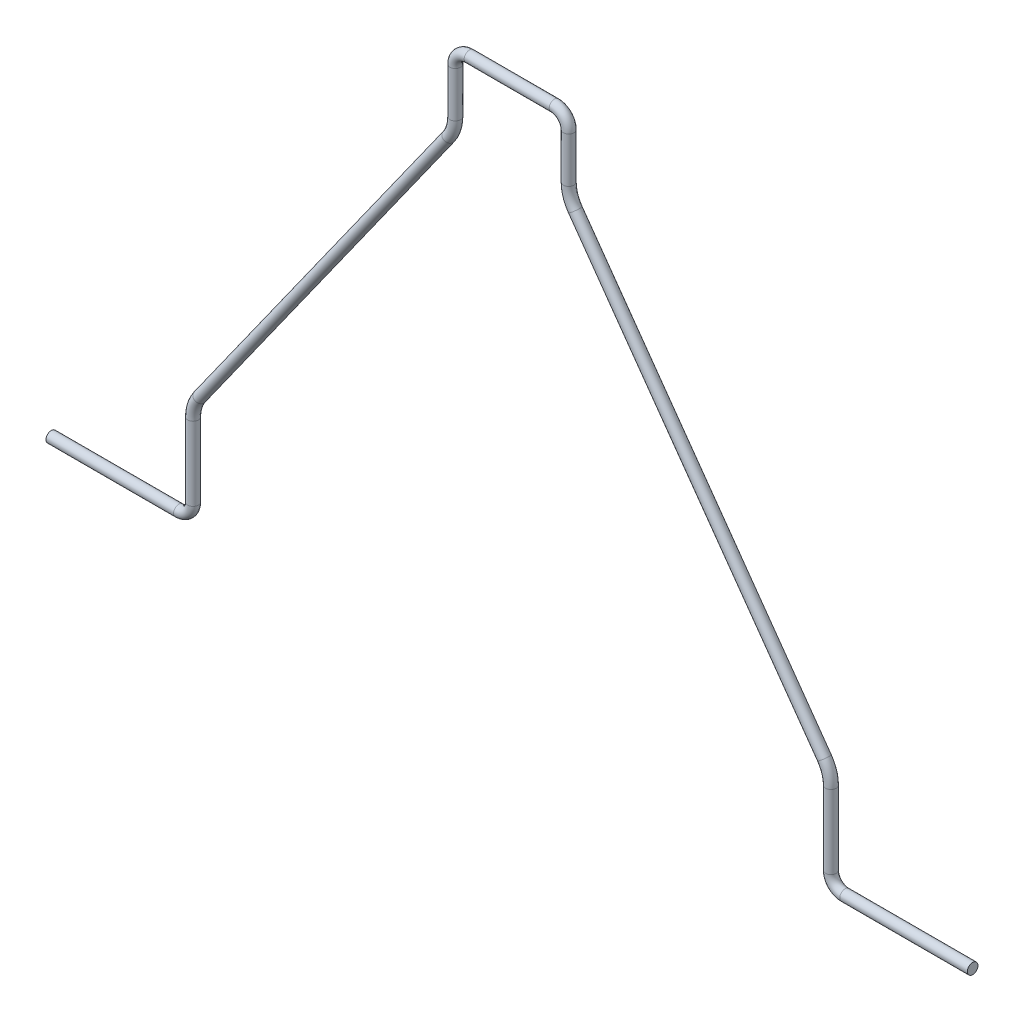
ISO-10303-21;
HEADER;
FILE_DESCRIPTION(('STEP AP214'),'2;1');
FILE_NAME('part.step','',(''),(''),'','','');
FILE_SCHEMA(('AUTOMOTIVE_DESIGN { 1 0 10303 214 1 1 1 1 }'));
ENDSEC;
DATA;
#1=APPLICATION_CONTEXT('core data for automotive mechanical design processes');
#2=APPLICATION_PROTOCOL_DEFINITION('international standard','automotive_design',2000,#1);
#3=PRODUCT_CONTEXT('',#1,'mechanical');
#4=PRODUCT('Part','Part','',(#3));
#5=PRODUCT_RELATED_PRODUCT_CATEGORY('part','',(#4));
#6=PRODUCT_DEFINITION_FORMATION('','',#4);
#7=PRODUCT_DEFINITION_CONTEXT('part definition',#1,'design');
#8=PRODUCT_DEFINITION('design','',#6,#7);
#9=PRODUCT_DEFINITION_SHAPE('','',#8);
#10=(LENGTH_UNIT() NAMED_UNIT(*) SI_UNIT(.MILLI.,.METRE.));
#11=(NAMED_UNIT(*) PLANE_ANGLE_UNIT() SI_UNIT($,.RADIAN.));
#12=(NAMED_UNIT(*) SI_UNIT($,.STERADIAN.) SOLID_ANGLE_UNIT());
#13=UNCERTAINTY_MEASURE_WITH_UNIT(LENGTH_MEASURE(1.E-05),#10,'distance_accuracy_value','');
#14=(GEOMETRIC_REPRESENTATION_CONTEXT(3) GLOBAL_UNCERTAINTY_ASSIGNED_CONTEXT((#13)) GLOBAL_UNIT_ASSIGNED_CONTEXT((#10,
#11,#12)) REPRESENTATION_CONTEXT('',''));
#15=CARTESIAN_POINT('',(0.,0.,0.));
#16=DIRECTION('',(0.,0.,1.));
#17=DIRECTION('',(1.,0.,0.));
#18=AXIS2_PLACEMENT_3D('',#15,#16,#17);
#19=CARTESIAN_POINT('',(112.,0.,0.));
#20=DIRECTION('',(1.,0.,0.));
#21=DIRECTION('',(0.,1.,0.));
#22=AXIS2_PLACEMENT_3D('',#19,#20,#21);
#23=CYLINDRICAL_SURFACE('',#22,0.75);
#24=CARTESIAN_POINT('',(112.,0.,0.));
#25=DIRECTION('',(1.,0.,0.));
#26=DIRECTION('',(0.,0.,-1.));
#27=AXIS2_PLACEMENT_3D('',#24,#25,#26);
#28=CIRCLE('',#27,0.75);
#29=CARTESIAN_POINT('',(112.,-0.74999999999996,0.));
#30=VERTEX_POINT('',#29);
#31=EDGE_CURVE('E36',#30,#30,#28,.T.);
#32=ORIENTED_EDGE('',*,*,#31,.T.);
#33=EDGE_LOOP('',(#32));
#34=FACE_BOUND('',#33,.T.);
#35=CARTESIAN_POINT('',(130.,0.,0.));
#36=DIRECTION('',(1.,0.,0.));
#37=DIRECTION('',(0.,0.,-1.));
#38=AXIS2_PLACEMENT_3D('',#35,#36,#37);
#39=CIRCLE('',#38,0.75);
#40=CARTESIAN_POINT('',(130.,0.,-0.75));
#41=VERTEX_POINT('',#40);
#42=EDGE_CURVE('E10',#41,#41,#39,.T.);
#43=ORIENTED_EDGE('',*,*,#42,.F.);
#44=EDGE_LOOP('',(#43));
#45=FACE_BOUND('',#44,.T.);
#46=ADVANCED_FACE('F30',(#34,#45),#23,.T.);
#47=CARTESIAN_POINT('',(112.,2.00000000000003,0.));
#48=DIRECTION('',(0.,0.,1.));
#49=DIRECTION('',(1.,0.,0.));
#50=AXIS2_PLACEMENT_3D('',#47,#48,#49);
#51=TOROIDAL_SURFACE('',#50,1.99999999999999,0.75);
#52=CARTESIAN_POINT('',(110.,2.00000000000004,0.));
#53=DIRECTION('',(0.,-1.,0.));
#54=DIRECTION('',(0.,0.,-1.));
#55=AXIS2_PLACEMENT_3D('',#52,#53,#54);
#56=CIRCLE('',#55,0.75);
#57=CARTESIAN_POINT('',(109.25,2.00000000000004,0.));
#58=VERTEX_POINT('',#57);
#59=EDGE_CURVE('E40',#58,#58,#56,.T.);
#60=CARTESIAN_POINT('',(112.,2.00000000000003,0.));
#61=DIRECTION('',(0.,0.,1.));
#62=DIRECTION('',(1.,0.,0.));
#63=AXIS2_PLACEMENT_3D('',#60,#61,#62);
#64=CIRCLE('',#63,2.74999999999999);
#65=EDGE_CURVE('',#58,#30,#64,.T.);
#66=ORIENTED_EDGE('',*,*,#59,.T.);
#67=ORIENTED_EDGE('',*,*,#31,.F.);
#68=ORIENTED_EDGE('',*,*,#65,.T.);
#69=ORIENTED_EDGE('',*,*,#65,.F.);
#70=EDGE_LOOP('',(#66,#68,#67,#69));
#71=FACE_BOUND('',#70,.T.);
#72=ADVANCED_FACE('F110',(#71),#51,.T.);
#73=CARTESIAN_POINT('',(110.,12.4026946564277,0.));
#74=DIRECTION('',(0.,-1.,0.));
#75=DIRECTION('',(0.,0.,-1.));
#76=AXIS2_PLACEMENT_3D('',#73,#74,#75);
#77=CYLINDRICAL_SURFACE('',#76,0.75);
#78=CARTESIAN_POINT('',(110.,12.4026946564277,0.));
#79=DIRECTION('',(0.,-1.,0.));
#80=DIRECTION('',(0.,0.,-1.));
#81=AXIS2_PLACEMENT_3D('',#78,#79,#80);
#82=CIRCLE('',#81,0.75);
#83=CARTESIAN_POINT('',(110.75,12.4026946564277,0.));
#84=VERTEX_POINT('',#83);
#85=EDGE_CURVE('E44',#84,#84,#82,.T.);
#86=ORIENTED_EDGE('',*,*,#85,.T.);
#87=EDGE_LOOP('',(#86));
#88=FACE_BOUND('',#87,.T.);
#89=ORIENTED_EDGE('',*,*,#59,.F.);
#90=EDGE_LOOP('',(#89));
#91=FACE_BOUND('',#90,.T.);
#92=ADVANCED_FACE('F114',(#88,#91),#77,.T.);
#93=CARTESIAN_POINT('',(105.,12.4026946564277,0.));
#94=DIRECTION('',(0.,0.,-1.));
#95=DIRECTION('',(-1.,0.,0.));
#96=AXIS2_PLACEMENT_3D('',#93,#94,#95);
#97=TOROIDAL_SURFACE('',#96,5.00000000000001,0.75);
#98=CARTESIAN_POINT('',(109.073954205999,15.3014697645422,0.));
#99=DIRECTION('',(0.579755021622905,-0.814790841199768,0.));
#100=DIRECTION('',(0.,0.,-1.));
#101=AXIS2_PLACEMENT_3D('',#98,#99,#100);
#102=CIRCLE('',#101,0.75);
#103=CARTESIAN_POINT('',(109.685047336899,15.7362860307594,0.));
#104=VERTEX_POINT('',#103);
#105=EDGE_CURVE('E49',#104,#104,#102,.T.);
#106=CARTESIAN_POINT('',(105.,12.4026946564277,0.));
#107=DIRECTION('',(0.,0.,-1.));
#108=DIRECTION('',(-1.,0.,0.));
#109=AXIS2_PLACEMENT_3D('',#106,#107,#108);
#110=CIRCLE('',#109,5.75000000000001);
#111=EDGE_CURVE('',#104,#84,#110,.T.);
#112=ORIENTED_EDGE('',*,*,#105,.T.);
#113=ORIENTED_EDGE('',*,*,#85,.F.);
#114=ORIENTED_EDGE('',*,*,#111,.T.);
#115=ORIENTED_EDGE('',*,*,#111,.F.);
#116=EDGE_LOOP('',(#112,#114,#113,#115));
#117=FACE_BOUND('',#116,.T.);
#118=ADVANCED_FACE('F120',(#117),#97,.T.);
#119=CARTESIAN_POINT('',(73.9260457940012,64.6985302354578,0.));
#120=DIRECTION('',(0.57975502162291,-0.814790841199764,0.));
#121=DIRECTION('',(0.814790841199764,0.57975502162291,0.));
#122=AXIS2_PLACEMENT_3D('',#119,#120,#121);
#123=CYLINDRICAL_SURFACE('',#122,0.75);
#124=CARTESIAN_POINT('',(73.9260457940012,64.6985302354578,0.));
#125=DIRECTION('',(0.579755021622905,-0.814790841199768,0.));
#126=DIRECTION('',(0.,0.,-1.));
#127=AXIS2_PLACEMENT_3D('',#124,#125,#126);
#128=CIRCLE('',#127,0.75);
#129=CARTESIAN_POINT('',(73.3149526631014,64.2637139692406,0.));
#130=VERTEX_POINT('',#129);
#131=EDGE_CURVE('E52',#130,#130,#128,.T.);
#132=ORIENTED_EDGE('',*,*,#131,.T.);
#133=EDGE_LOOP('',(#132));
#134=FACE_BOUND('',#133,.T.);
#135=ORIENTED_EDGE('',*,*,#105,.F.);
#136=EDGE_LOOP('',(#135));
#137=FACE_BOUND('',#136,.T.);
#138=ADVANCED_FACE('F127',(#134,#137),#123,.T.);
#139=CARTESIAN_POINT('',(78.,67.5973053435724,0.));
#140=DIRECTION('',(0.,0.,1.));
#141=DIRECTION('',(1.,0.,0.));
#142=AXIS2_PLACEMENT_3D('',#139,#140,#141);
#143=TOROIDAL_SURFACE('',#142,5.,0.75);
#144=CARTESIAN_POINT('',(73.,67.5973053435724,0.));
#145=DIRECTION('',(0.,-1.,0.));
#146=DIRECTION('',(0.,0.,-1.));
#147=AXIS2_PLACEMENT_3D('',#144,#145,#146);
#148=CIRCLE('',#147,0.75);
#149=CARTESIAN_POINT('',(72.25,67.5973053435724,0.));
#150=VERTEX_POINT('',#149);
#151=EDGE_CURVE('E55',#150,#150,#148,.T.);
#152=CARTESIAN_POINT('',(78.,67.5973053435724,0.));
#153=DIRECTION('',(0.,0.,1.));
#154=DIRECTION('',(1.,0.,0.));
#155=AXIS2_PLACEMENT_3D('',#152,#153,#154);
#156=CIRCLE('',#155,5.75);
#157=EDGE_CURVE('',#150,#130,#156,.T.);
#158=ORIENTED_EDGE('',*,*,#151,.T.);
#159=ORIENTED_EDGE('',*,*,#131,.F.);
#160=ORIENTED_EDGE('',*,*,#157,.T.);
#161=ORIENTED_EDGE('',*,*,#157,.F.);
#162=EDGE_LOOP('',(#158,#160,#159,#161));
#163=FACE_BOUND('',#162,.T.);
#164=ADVANCED_FACE('F131',(#163),#143,.T.);
#165=CARTESIAN_POINT('',(73.,74.,0.));
#166=DIRECTION('',(0.,-1.,0.));
#167=DIRECTION('',(0.,0.,-1.));
#168=AXIS2_PLACEMENT_3D('',#165,#166,#167);
#169=CYLINDRICAL_SURFACE('',#168,0.75);
#170=CARTESIAN_POINT('',(73.,74.,0.));
#171=DIRECTION('',(0.,-1.,0.));
#172=DIRECTION('',(0.,0.,-1.));
#173=AXIS2_PLACEMENT_3D('',#170,#171,#172);
#174=CIRCLE('',#173,0.75);
#175=CARTESIAN_POINT('',(73.75,74.,0.));
#176=VERTEX_POINT('',#175);
#177=EDGE_CURVE('E58',#176,#176,#174,.T.);
#178=ORIENTED_EDGE('',*,*,#177,.T.);
#179=EDGE_LOOP('',(#178));
#180=FACE_BOUND('',#179,.T.);
#181=ORIENTED_EDGE('',*,*,#151,.F.);
#182=EDGE_LOOP('',(#181));
#183=FACE_BOUND('',#182,.T.);
#184=ADVANCED_FACE('F135',(#180,#183),#169,.T.);
#185=CARTESIAN_POINT('',(71.,74.,0.));
#186=DIRECTION('',(0.,0.,-1.));
#187=DIRECTION('',(-1.,0.,0.));
#188=AXIS2_PLACEMENT_3D('',#185,#186,#187);
#189=TOROIDAL_SURFACE('',#188,1.99999999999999,0.75);
#190=CARTESIAN_POINT('',(71.,76.,0.));
#191=DIRECTION('',(1.,0.,0.));
#192=DIRECTION('',(0.,0.,-1.));
#193=AXIS2_PLACEMENT_3D('',#190,#191,#192);
#194=CIRCLE('',#193,0.75);
#195=CARTESIAN_POINT('',(71.,76.75,0.));
#196=VERTEX_POINT('',#195);
#197=EDGE_CURVE('E61',#196,#196,#194,.T.);
#198=CARTESIAN_POINT('',(71.,74.,0.));
#199=DIRECTION('',(0.,0.,-1.));
#200=DIRECTION('',(-1.,0.,0.));
#201=AXIS2_PLACEMENT_3D('',#198,#199,#200);
#202=CIRCLE('',#201,2.74999999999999);
#203=EDGE_CURVE('',#196,#176,#202,.T.);
#204=ORIENTED_EDGE('',*,*,#197,.T.);
#205=ORIENTED_EDGE('',*,*,#177,.F.);
#206=ORIENTED_EDGE('',*,*,#203,.T.);
#207=ORIENTED_EDGE('',*,*,#203,.F.);
#208=EDGE_LOOP('',(#204,#206,#205,#207));
#209=FACE_BOUND('',#208,.T.);
#210=ADVANCED_FACE('F139',(#209),#189,.T.);
#211=CARTESIAN_POINT('',(59.,76.,0.));
#212=DIRECTION('',(1.,0.,0.));
#213=DIRECTION('',(0.,0.,-1.));
#214=AXIS2_PLACEMENT_3D('',#211,#212,#213);
#215=CYLINDRICAL_SURFACE('',#214,0.75);
#216=CARTESIAN_POINT('',(59.,76.,0.));
#217=DIRECTION('',(1.,0.,0.));
#218=DIRECTION('',(0.,0.,-1.));
#219=AXIS2_PLACEMENT_3D('',#216,#217,#218);
#220=CIRCLE('',#219,0.75);
#221=CARTESIAN_POINT('',(59.,76.75,0.));
#222=VERTEX_POINT('',#221);
#223=EDGE_CURVE('E64',#222,#222,#220,.T.);
#224=ORIENTED_EDGE('',*,*,#223,.T.);
#225=EDGE_LOOP('',(#224));
#226=FACE_BOUND('',#225,.T.);
#227=ORIENTED_EDGE('',*,*,#197,.F.);
#228=EDGE_LOOP('',(#227));
#229=FACE_BOUND('',#228,.T.);
#230=ADVANCED_FACE('F143',(#226,#229),#215,.T.);
#231=CARTESIAN_POINT('',(59.,74.,0.));
#232=DIRECTION('',(0.,0.,-1.));
#233=DIRECTION('',(-1.,0.,0.));
#234=AXIS2_PLACEMENT_3D('',#231,#232,#233);
#235=TOROIDAL_SURFACE('',#234,1.99999999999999,0.75);
#236=CARTESIAN_POINT('',(57.,74.,0.));
#237=DIRECTION('',(0.,1.,0.));
#238=DIRECTION('',(0.,0.,-1.));
#239=AXIS2_PLACEMENT_3D('',#236,#237,#238);
#240=CIRCLE('',#239,0.75);
#241=CARTESIAN_POINT('',(56.25,74.,0.));
#242=VERTEX_POINT('',#241);
#243=EDGE_CURVE('E67',#242,#242,#240,.T.);
#244=CARTESIAN_POINT('',(59.,74.,0.));
#245=DIRECTION('',(0.,0.,-1.));
#246=DIRECTION('',(-1.,0.,0.));
#247=AXIS2_PLACEMENT_3D('',#244,#245,#246);
#248=CIRCLE('',#247,2.75);
#249=EDGE_CURVE('',#242,#222,#248,.T.);
#250=ORIENTED_EDGE('',*,*,#243,.T.);
#251=ORIENTED_EDGE('',*,*,#223,.F.);
#252=ORIENTED_EDGE('',*,*,#249,.T.);
#253=ORIENTED_EDGE('',*,*,#249,.F.);
#254=EDGE_LOOP('',(#250,#252,#251,#253));
#255=FACE_BOUND('',#254,.T.);
#256=ADVANCED_FACE('F147',(#255),#235,.T.);
#257=CARTESIAN_POINT('',(57.,67.5973053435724,0.));
#258=DIRECTION('',(0.,1.,0.));
#259=DIRECTION('',(0.,0.,1.));
#260=AXIS2_PLACEMENT_3D('',#257,#258,#259);
#261=CYLINDRICAL_SURFACE('',#260,0.75);
#262=CARTESIAN_POINT('',(57.,67.5973053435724,0.));
#263=DIRECTION('',(0.,1.,0.));
#264=DIRECTION('',(0.,0.,-1.));
#265=AXIS2_PLACEMENT_3D('',#262,#263,#264);
#266=CIRCLE('',#265,0.75);
#267=CARTESIAN_POINT('',(57.75,67.5973053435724,0.));
#268=VERTEX_POINT('',#267);
#269=EDGE_CURVE('E70',#268,#268,#266,.T.);
#270=ORIENTED_EDGE('',*,*,#269,.T.);
#271=EDGE_LOOP('',(#270));
#272=FACE_BOUND('',#271,.T.);
#273=ORIENTED_EDGE('',*,*,#243,.F.);
#274=EDGE_LOOP('',(#273));
#275=FACE_BOUND('',#274,.T.);
#276=ADVANCED_FACE('F151',(#272,#275),#261,.T.);
#277=CARTESIAN_POINT('',(52.,67.5973053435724,0.));
#278=DIRECTION('',(0.,0.,1.));
#279=DIRECTION('',(1.,0.,0.));
#280=AXIS2_PLACEMENT_3D('',#277,#278,#279);
#281=TOROIDAL_SURFACE('',#280,5.,0.75);
#282=CARTESIAN_POINT('',(56.0739542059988,64.6985302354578,0.));
#283=DIRECTION('',(0.579755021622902,0.814790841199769,0.));
#284=DIRECTION('',(0.,0.,-1.));
#285=AXIS2_PLACEMENT_3D('',#282,#283,#284);
#286=CIRCLE('',#285,0.75);
#287=CARTESIAN_POINT('',(56.6850473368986,64.2637139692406,0.));
#288=VERTEX_POINT('',#287);
#289=EDGE_CURVE('E73',#288,#288,#286,.T.);
#290=CARTESIAN_POINT('',(52.,67.5973053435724,0.));
#291=DIRECTION('',(0.,0.,1.));
#292=DIRECTION('',(1.,0.,0.));
#293=AXIS2_PLACEMENT_3D('',#290,#291,#292);
#294=CIRCLE('',#293,5.75);
#295=EDGE_CURVE('',#288,#268,#294,.T.);
#296=ORIENTED_EDGE('',*,*,#289,.T.);
#297=ORIENTED_EDGE('',*,*,#269,.F.);
#298=ORIENTED_EDGE('',*,*,#295,.T.);
#299=ORIENTED_EDGE('',*,*,#295,.F.);
#300=EDGE_LOOP('',(#296,#298,#297,#299));
#301=FACE_BOUND('',#300,.T.);
#302=ADVANCED_FACE('F155',(#301),#281,.T.);
#303=CARTESIAN_POINT('',(20.9260457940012,15.3014697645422,0.));
#304=DIRECTION('',(0.579755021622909,0.814790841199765,0.));
#305=DIRECTION('',(-0.814790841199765,0.579755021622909,0.));
#306=AXIS2_PLACEMENT_3D('',#303,#304,#305);
#307=CYLINDRICAL_SURFACE('',#306,0.75);
#308=CARTESIAN_POINT('',(20.9260457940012,15.3014697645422,0.));
#309=DIRECTION('',(0.579755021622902,0.814790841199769,0.));
#310=DIRECTION('',(0.,0.,-1.));
#311=AXIS2_PLACEMENT_3D('',#308,#309,#310);
#312=CIRCLE('',#311,0.75);
#313=CARTESIAN_POINT('',(20.3149526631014,15.7362860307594,0.));
#314=VERTEX_POINT('',#313);
#315=EDGE_CURVE('E76',#314,#314,#312,.T.);
#316=ORIENTED_EDGE('',*,*,#315,.T.);
#317=EDGE_LOOP('',(#316));
#318=FACE_BOUND('',#317,.T.);
#319=ORIENTED_EDGE('',*,*,#289,.F.);
#320=EDGE_LOOP('',(#319));
#321=FACE_BOUND('',#320,.T.);
#322=ADVANCED_FACE('F159',(#318,#321),#307,.T.);
#323=CARTESIAN_POINT('',(25.,12.4026946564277,0.));
#324=DIRECTION('',(0.,0.,-1.));
#325=DIRECTION('',(-1.,0.,0.));
#326=AXIS2_PLACEMENT_3D('',#323,#324,#325);
#327=TOROIDAL_SURFACE('',#326,5.,0.75);
#328=CARTESIAN_POINT('',(20.,12.4026946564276,0.));
#329=DIRECTION('',(0.,1.,0.));
#330=DIRECTION('',(0.,0.,-1.));
#331=AXIS2_PLACEMENT_3D('',#328,#329,#330);
#332=CIRCLE('',#331,0.75);
#333=CARTESIAN_POINT('',(19.25,12.4026946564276,0.));
#334=VERTEX_POINT('',#333);
#335=EDGE_CURVE('E79',#334,#334,#332,.T.);
#336=CARTESIAN_POINT('',(25.,12.4026946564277,0.));
#337=DIRECTION('',(0.,0.,-1.));
#338=DIRECTION('',(-1.,0.,0.));
#339=AXIS2_PLACEMENT_3D('',#336,#337,#338);
#340=CIRCLE('',#339,5.75);
#341=EDGE_CURVE('',#334,#314,#340,.T.);
#342=ORIENTED_EDGE('',*,*,#335,.T.);
#343=ORIENTED_EDGE('',*,*,#315,.F.);
#344=ORIENTED_EDGE('',*,*,#341,.T.);
#345=ORIENTED_EDGE('',*,*,#341,.F.);
#346=EDGE_LOOP('',(#342,#344,#343,#345));
#347=FACE_BOUND('',#346,.T.);
#348=ADVANCED_FACE('F163',(#347),#327,.T.);
#349=CARTESIAN_POINT('',(20.,2.00000000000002,0.));
#350=DIRECTION('',(0.,1.,0.));
#351=DIRECTION('',(0.,0.,1.));
#352=AXIS2_PLACEMENT_3D('',#349,#350,#351);
#353=CYLINDRICAL_SURFACE('',#352,0.75);
#354=CARTESIAN_POINT('',(20.,2.00000000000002,0.));
#355=DIRECTION('',(0.,1.,0.));
#356=DIRECTION('',(0.,0.,-1.));
#357=AXIS2_PLACEMENT_3D('',#354,#355,#356);
#358=CIRCLE('',#357,0.75);
#359=CARTESIAN_POINT('',(20.75,2.00000000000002,0.));
#360=VERTEX_POINT('',#359);
#361=EDGE_CURVE('E82',#360,#360,#358,.T.);
#362=ORIENTED_EDGE('',*,*,#361,.T.);
#363=EDGE_LOOP('',(#362));
#364=FACE_BOUND('',#363,.T.);
#365=ORIENTED_EDGE('',*,*,#335,.F.);
#366=EDGE_LOOP('',(#365));
#367=FACE_BOUND('',#366,.T.);
#368=ADVANCED_FACE('F167',(#364,#367),#353,.T.);
#369=CARTESIAN_POINT('',(18.,2.,0.));
#370=DIRECTION('',(0.,0.,1.));
#371=DIRECTION('',(1.,0.,0.));
#372=AXIS2_PLACEMENT_3D('',#369,#370,#371);
#373=TOROIDAL_SURFACE('',#372,2.,0.75);
#374=CARTESIAN_POINT('',(18.,0.,0.));
#375=DIRECTION('',(1.,0.,0.));
#376=DIRECTION('',(0.,0.,-1.));
#377=AXIS2_PLACEMENT_3D('',#374,#375,#376);
#378=CIRCLE('',#377,0.75);
#379=CARTESIAN_POINT('',(18.,-0.75,0.));
#380=VERTEX_POINT('',#379);
#381=EDGE_CURVE('E85',#380,#380,#378,.T.);
#382=CARTESIAN_POINT('',(18.,2.,0.));
#383=DIRECTION('',(0.,0.,1.));
#384=DIRECTION('',(1.,0.,0.));
#385=AXIS2_PLACEMENT_3D('',#382,#383,#384);
#386=CIRCLE('',#385,2.75);
#387=EDGE_CURVE('',#380,#360,#386,.T.);
#388=ORIENTED_EDGE('',*,*,#381,.T.);
#389=ORIENTED_EDGE('',*,*,#361,.F.);
#390=ORIENTED_EDGE('',*,*,#387,.T.);
#391=ORIENTED_EDGE('',*,*,#387,.F.);
#392=EDGE_LOOP('',(#388,#390,#389,#391));
#393=FACE_BOUND('',#392,.T.);
#394=ADVANCED_FACE('F92',(#393),#373,.T.);
#395=CARTESIAN_POINT('',(18.,0.,0.));
#396=DIRECTION('',(-1.,0.,0.));
#397=DIRECTION('',(0.,0.,1.));
#398=AXIS2_PLACEMENT_3D('',#395,#396,#397);
#399=CYLINDRICAL_SURFACE('',#398,0.75);
#400=ORIENTED_EDGE('',*,*,#381,.F.);
#401=EDGE_LOOP('',(#400));
#402=FACE_BOUND('',#401,.T.);
#403=CARTESIAN_POINT('',(0.,0.,0.));
#404=DIRECTION('',(1.,0.,0.));
#405=DIRECTION('',(0.,0.,-1.));
#406=AXIS2_PLACEMENT_3D('',#403,#404,#405);
#407=CIRCLE('',#406,0.75);
#408=CARTESIAN_POINT('',(0.,0.,-0.75));
#409=VERTEX_POINT('',#408);
#410=EDGE_CURVE('E86',#409,#409,#407,.T.);
#411=ORIENTED_EDGE('',*,*,#410,.T.);
#412=EDGE_LOOP('',(#411));
#413=FACE_BOUND('',#412,.T.);
#414=ADVANCED_FACE('F95',(#402,#413),#399,.T.);
#415=CARTESIAN_POINT('',(130.,0.,0.));
#416=DIRECTION('',(1.,0.,0.));
#417=DIRECTION('',(0.,0.,-1.));
#418=AXIS2_PLACEMENT_3D('',#415,#416,#417);
#419=PLANE('',#418);
#420=ORIENTED_EDGE('',*,*,#42,.T.);
#421=EDGE_LOOP('',(#420));
#422=FACE_BOUND('',#421,.T.);
#423=ADVANCED_FACE('F98',(#422),#419,.T.);
#424=CARTESIAN_POINT('',(0.,0.,0.));
#425=DIRECTION('',(1.,0.,0.));
#426=DIRECTION('',(0.,0.,-1.));
#427=AXIS2_PLACEMENT_3D('',#424,#425,#426);
#428=PLANE('',#427);
#429=ORIENTED_EDGE('',*,*,#410,.F.);
#430=EDGE_LOOP('',(#429));
#431=FACE_BOUND('',#430,.T.);
#432=ADVANCED_FACE('F102',(#431),#428,.F.);
#433=CLOSED_SHELL('',(#46,#72,#92,#118,#138,#164,#184,#210,#230,#256,#276,#302,#322,#348,#368,
#394,#414,#423,#432));
#434=MANIFOLD_SOLID_BREP('B2',#433);
#435=ADVANCED_BREP_SHAPE_REPRESENTATION('',(#18,#434),#14);
#436=SHAPE_DEFINITION_REPRESENTATION(#9,#435);
ENDSEC;
END-ISO-10303-21;
